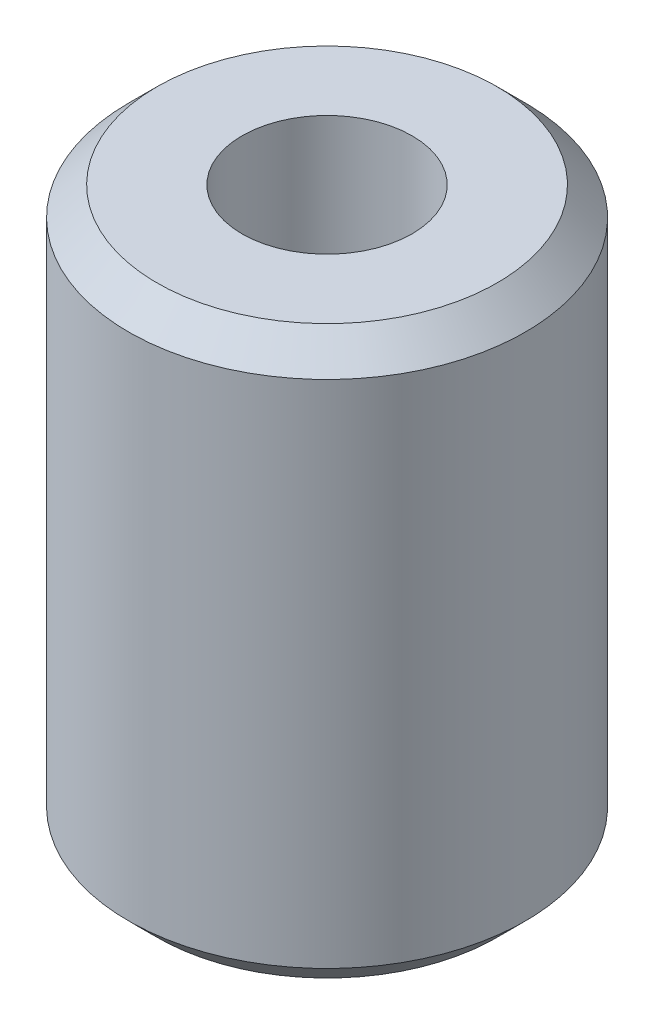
from build123d import *


with BuildPart() as part:
    # Sketch1 → Revolve1 (revolve)
    with BuildSketch(Plane.XY, mode=Mode.PRIVATE) as revolve1_sk:
        Polygon((1.5, -5), (1.5, 5), (3, 5), (3.5, 4.5), (3.5, -4.5), (3, -5), align=None)
    revolve(revolve1_sk.sketch.rotate(Axis((0, 5, 0), (0, -1, 0)), 180), axis=Axis((0, 5, 0), (0, -1, 0)))


solid = part.part
